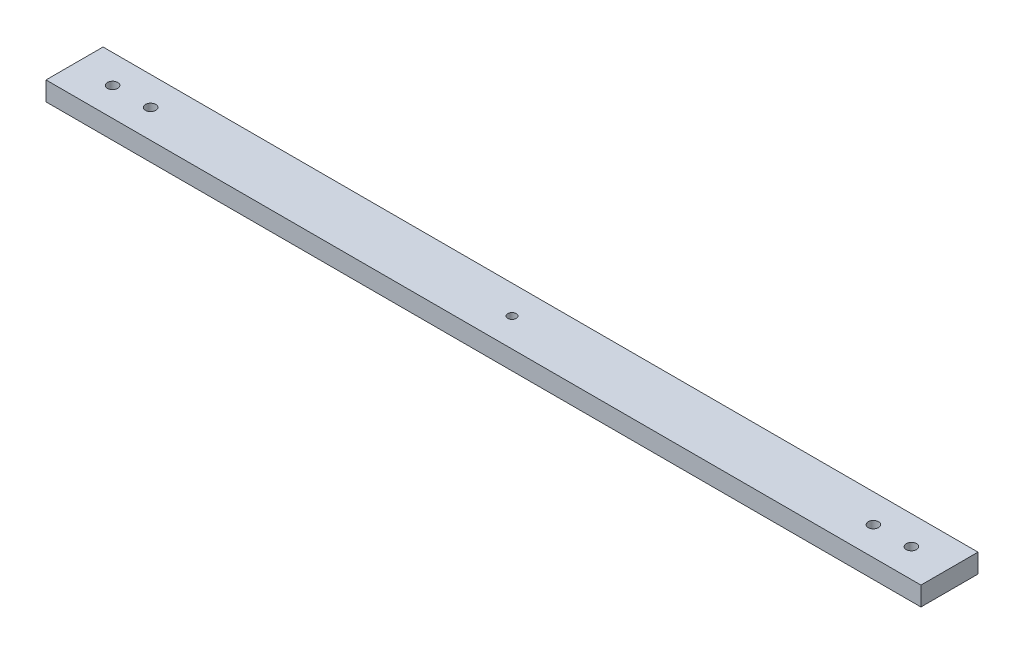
ISO-10303-21;
HEADER;
FILE_DESCRIPTION(('STEP AP214'),'2;1');
FILE_NAME('part.step','',(''),(''),'','','');
FILE_SCHEMA(('AUTOMOTIVE_DESIGN { 1 0 10303 214 1 1 1 1 }'));
ENDSEC;
DATA;
#1=APPLICATION_CONTEXT('core data for automotive mechanical design processes');
#2=APPLICATION_PROTOCOL_DEFINITION('international standard','automotive_design',2000,#1);
#3=PRODUCT_CONTEXT('',#1,'mechanical');
#4=PRODUCT('Part','Part','',(#3));
#5=PRODUCT_RELATED_PRODUCT_CATEGORY('part','',(#4));
#6=PRODUCT_DEFINITION_FORMATION('','',#4);
#7=PRODUCT_DEFINITION_CONTEXT('part definition',#1,'design');
#8=PRODUCT_DEFINITION('design','',#6,#7);
#9=PRODUCT_DEFINITION_SHAPE('','',#8);
#10=(LENGTH_UNIT() NAMED_UNIT(*) SI_UNIT(.MILLI.,.METRE.));
#11=(NAMED_UNIT(*) PLANE_ANGLE_UNIT() SI_UNIT($,.RADIAN.));
#12=(NAMED_UNIT(*) SI_UNIT($,.STERADIAN.) SOLID_ANGLE_UNIT());
#13=UNCERTAINTY_MEASURE_WITH_UNIT(LENGTH_MEASURE(1.E-05),#10,'distance_accuracy_value','');
#14=(GEOMETRIC_REPRESENTATION_CONTEXT(3) GLOBAL_UNCERTAINTY_ASSIGNED_CONTEXT((#13)) GLOBAL_UNIT_ASSIGNED_CONTEXT((#10,
#11,#12)) REPRESENTATION_CONTEXT('',''));
#15=CARTESIAN_POINT('',(0.,0.,0.));
#16=DIRECTION('',(0.,0.,1.));
#17=DIRECTION('',(1.,0.,0.));
#18=AXIS2_PLACEMENT_3D('',#15,#16,#17);
#19=CARTESIAN_POINT('',(0.,0.,0.));
#20=DIRECTION('',(0.,-1.,0.));
#21=DIRECTION('',(0.,0.,-1.));
#22=AXIS2_PLACEMENT_3D('',#19,#20,#21);
#23=PLANE('',#22);
#24=CARTESIAN_POINT('',(0.,0.,3.17499999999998));
#25=DIRECTION('',(0.,1.,0.));
#26=DIRECTION('',(0.,0.,1.));
#27=AXIS2_PLACEMENT_3D('',#24,#25,#26);
#28=CIRCLE('',#27,1.4224);
#29=CARTESIAN_POINT('',(0.,0.,4.59739999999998));
#30=VERTEX_POINT('',#29);
#31=EDGE_CURVE('E134',#30,#30,#28,.T.);
#32=ORIENTED_EDGE('',*,*,#31,.T.);
#33=EDGE_LOOP('',(#32));
#34=FACE_BOUND('',#33,.T.);
#35=CARTESIAN_POINT('',(133.35,0.,3.175));
#36=DIRECTION('',(0.,1.,0.));
#37=DIRECTION('',(0.,0.,1.));
#38=AXIS2_PLACEMENT_3D('',#35,#36,#37);
#39=CIRCLE('',#38,1.72719999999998);
#40=CARTESIAN_POINT('',(133.35,0.,4.90219999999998));
#41=VERTEX_POINT('',#40);
#42=EDGE_CURVE('E128',#41,#41,#39,.T.);
#43=ORIENTED_EDGE('',*,*,#42,.T.);
#44=EDGE_LOOP('',(#43));
#45=FACE_BOUND('',#44,.T.);
#46=DIRECTION('',(0.,0.,-1.));
#47=VECTOR('',#46,1.);
#48=CARTESIAN_POINT('',(146.05,0.,12.7));
#49=LINE('',#48,#47);
#50=CARTESIAN_POINT('',(146.05,0.,12.7));
#51=VERTEX_POINT('',#50);
#52=CARTESIAN_POINT('',(146.05,0.,-6.35));
#53=VERTEX_POINT('',#52);
#54=EDGE_CURVE('E97',#51,#53,#49,.T.);
#55=ORIENTED_EDGE('',*,*,#54,.F.);
#56=DIRECTION('',(1.,0.,0.));
#57=VECTOR('',#56,1.);
#58=CARTESIAN_POINT('',(-146.05,0.,12.7));
#59=LINE('',#58,#57);
#60=CARTESIAN_POINT('',(-146.05,0.,12.7));
#61=VERTEX_POINT('',#60);
#62=EDGE_CURVE('E73',#61,#51,#59,.T.);
#63=ORIENTED_EDGE('',*,*,#62,.F.);
#64=DIRECTION('',(0.,0.,1.));
#65=VECTOR('',#64,1.);
#66=CARTESIAN_POINT('',(-146.05,0.,12.7));
#67=LINE('',#66,#65);
#68=CARTESIAN_POINT('',(-146.05,0.,-6.35));
#69=VERTEX_POINT('',#68);
#70=EDGE_CURVE('E67',#69,#61,#67,.T.);
#71=ORIENTED_EDGE('',*,*,#70,.F.);
#72=DIRECTION('',(-1.,0.,0.));
#73=VECTOR('',#72,1.);
#74=CARTESIAN_POINT('',(-146.05,0.,-6.35));
#75=LINE('',#74,#73);
#76=EDGE_CURVE('E89',#53,#69,#75,.T.);
#77=ORIENTED_EDGE('',*,*,#76,.F.);
#78=EDGE_LOOP('',(#55,#63,#71,#77));
#79=FACE_BOUND('',#78,.T.);
#80=CARTESIAN_POINT('',(-120.65,0.,3.175));
#81=DIRECTION('',(0.,1.,0.));
#82=DIRECTION('',(0.,0.,1.));
#83=AXIS2_PLACEMENT_3D('',#80,#81,#82);
#84=CIRCLE('',#83,1.7272);
#85=CARTESIAN_POINT('',(-120.65,0.,4.9022));
#86=VERTEX_POINT('',#85);
#87=EDGE_CURVE('E100',#86,#86,#84,.T.);
#88=ORIENTED_EDGE('',*,*,#87,.T.);
#89=EDGE_LOOP('',(#88));
#90=FACE_BOUND('',#89,.T.);
#91=CARTESIAN_POINT('',(-133.35,0.,3.175));
#92=DIRECTION('',(0.,1.,0.));
#93=DIRECTION('',(0.,0.,1.));
#94=AXIS2_PLACEMENT_3D('',#91,#92,#93);
#95=CIRCLE('',#94,1.72719999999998);
#96=CARTESIAN_POINT('',(-133.35,0.,4.90219999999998));
#97=VERTEX_POINT('',#96);
#98=EDGE_CURVE('E116',#97,#97,#95,.T.);
#99=ORIENTED_EDGE('',*,*,#98,.T.);
#100=EDGE_LOOP('',(#99));
#101=FACE_BOUND('',#100,.T.);
#102=CARTESIAN_POINT('',(120.65,0.,3.175));
#103=DIRECTION('',(0.,1.,0.));
#104=DIRECTION('',(0.,0.,1.));
#105=AXIS2_PLACEMENT_3D('',#102,#103,#104);
#106=CIRCLE('',#105,1.7272);
#107=CARTESIAN_POINT('',(120.65,0.,4.9022));
#108=VERTEX_POINT('',#107);
#109=EDGE_CURVE('E122',#108,#108,#106,.T.);
#110=ORIENTED_EDGE('',*,*,#109,.T.);
#111=EDGE_LOOP('',(#110));
#112=FACE_BOUND('',#111,.T.);
#113=ADVANCED_FACE('F33',(#34,#45,#79,#90,#101,#112),#23,.T.);
#114=CARTESIAN_POINT('',(146.05,6.35,12.7));
#115=DIRECTION('',(-1.,0.,0.));
#116=DIRECTION('',(0.,0.,1.));
#117=AXIS2_PLACEMENT_3D('',#114,#115,#116);
#118=PLANE('',#117);
#119=ORIENTED_EDGE('',*,*,#54,.T.);
#120=DIRECTION('',(0.,-1.,0.));
#121=VECTOR('',#120,1.);
#122=CARTESIAN_POINT('',(146.05,6.35,-6.35));
#123=LINE('',#122,#121);
#124=CARTESIAN_POINT('',(146.05,6.35,-6.35));
#125=VERTEX_POINT('',#124);
#126=EDGE_CURVE('E11',#125,#53,#123,.T.);
#127=ORIENTED_EDGE('',*,*,#126,.F.);
#128=DIRECTION('',(0.,0.,-1.));
#129=VECTOR('',#128,1.);
#130=CARTESIAN_POINT('',(146.05,6.35,12.7));
#131=LINE('',#130,#129);
#132=CARTESIAN_POINT('',(146.05,6.35,12.7));
#133=VERTEX_POINT('',#132);
#134=EDGE_CURVE('E85',#133,#125,#131,.T.);
#135=ORIENTED_EDGE('',*,*,#134,.F.);
#136=DIRECTION('',(0.,-1.,0.));
#137=VECTOR('',#136,1.);
#138=CARTESIAN_POINT('',(146.05,6.35,12.7));
#139=LINE('',#138,#137);
#140=EDGE_CURVE('E93',#133,#51,#139,.T.);
#141=ORIENTED_EDGE('',*,*,#140,.T.);
#142=EDGE_LOOP('',(#119,#127,#135,#141));
#143=FACE_BOUND('',#142,.T.);
#144=ADVANCED_FACE('F35',(#143),#118,.F.);
#145=CARTESIAN_POINT('',(-146.05,6.35,-6.35));
#146=DIRECTION('',(0.,0.,1.));
#147=DIRECTION('',(1.,0.,0.));
#148=AXIS2_PLACEMENT_3D('',#145,#146,#147);
#149=PLANE('',#148);
#150=ORIENTED_EDGE('',*,*,#76,.T.);
#151=DIRECTION('',(0.,-1.,0.));
#152=VECTOR('',#151,1.);
#153=CARTESIAN_POINT('',(-146.05,6.35,-6.35));
#154=LINE('',#153,#152);
#155=CARTESIAN_POINT('',(-146.05,6.35,-6.35));
#156=VERTEX_POINT('',#155);
#157=EDGE_CURVE('E42',#156,#69,#154,.T.);
#158=ORIENTED_EDGE('',*,*,#157,.F.);
#159=DIRECTION('',(-1.,0.,0.));
#160=VECTOR('',#159,1.);
#161=CARTESIAN_POINT('',(-146.05,6.35,-6.35));
#162=LINE('',#161,#160);
#163=EDGE_CURVE('E80',#125,#156,#162,.T.);
#164=ORIENTED_EDGE('',*,*,#163,.F.);
#165=ORIENTED_EDGE('',*,*,#126,.T.);
#166=EDGE_LOOP('',(#150,#158,#164,#165));
#167=FACE_BOUND('',#166,.T.);
#168=ADVANCED_FACE('F88',(#167),#149,.F.);
#169=CARTESIAN_POINT('',(-146.05,6.35,12.7));
#170=DIRECTION('',(1.,0.,0.));
#171=DIRECTION('',(0.,0.,-1.));
#172=AXIS2_PLACEMENT_3D('',#169,#170,#171);
#173=PLANE('',#172);
#174=ORIENTED_EDGE('',*,*,#70,.T.);
#175=DIRECTION('',(0.,-1.,0.));
#176=VECTOR('',#175,1.);
#177=CARTESIAN_POINT('',(-146.05,6.35,12.7));
#178=LINE('',#177,#176);
#179=CARTESIAN_POINT('',(-146.05,6.35,12.7));
#180=VERTEX_POINT('',#179);
#181=EDGE_CURVE('E90',#180,#61,#178,.T.);
#182=ORIENTED_EDGE('',*,*,#181,.F.);
#183=DIRECTION('',(0.,0.,1.));
#184=VECTOR('',#183,1.);
#185=CARTESIAN_POINT('',(-146.05,6.35,12.7));
#186=LINE('',#185,#184);
#187=EDGE_CURVE('E83',#156,#180,#186,.T.);
#188=ORIENTED_EDGE('',*,*,#187,.F.);
#189=ORIENTED_EDGE('',*,*,#157,.T.);
#190=EDGE_LOOP('',(#174,#182,#188,#189));
#191=FACE_BOUND('',#190,.T.);
#192=ADVANCED_FACE('F91',(#191),#173,.F.);
#193=CARTESIAN_POINT('',(-146.05,6.35,12.7));
#194=DIRECTION('',(0.,0.,-1.));
#195=DIRECTION('',(-1.,0.,0.));
#196=AXIS2_PLACEMENT_3D('',#193,#194,#195);
#197=PLANE('',#196);
#198=ORIENTED_EDGE('',*,*,#62,.T.);
#199=ORIENTED_EDGE('',*,*,#140,.F.);
#200=DIRECTION('',(1.,0.,0.));
#201=VECTOR('',#200,1.);
#202=CARTESIAN_POINT('',(-146.05,6.35,12.7));
#203=LINE('',#202,#201);
#204=EDGE_CURVE('E50',#180,#133,#203,.T.);
#205=ORIENTED_EDGE('',*,*,#204,.F.);
#206=ORIENTED_EDGE('',*,*,#181,.T.);
#207=EDGE_LOOP('',(#198,#199,#205,#206));
#208=FACE_BOUND('',#207,.T.);
#209=ADVANCED_FACE('F105',(#208),#197,.F.);
#210=CARTESIAN_POINT('',(0.,6.35,0.));
#211=DIRECTION('',(0.,-1.,0.));
#212=DIRECTION('',(0.,0.,-1.));
#213=AXIS2_PLACEMENT_3D('',#210,#211,#212);
#214=PLANE('',#213);
#215=CARTESIAN_POINT('',(0.,6.35,3.17499999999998));
#216=DIRECTION('',(0.,1.,0.));
#217=DIRECTION('',(0.,0.,1.));
#218=AXIS2_PLACEMENT_3D('',#215,#216,#217);
#219=CIRCLE('',#218,1.42239999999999);
#220=CARTESIAN_POINT('',(0.,6.35,4.59739999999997));
#221=VERTEX_POINT('',#220);
#222=EDGE_CURVE('E137',#221,#221,#219,.T.);
#223=ORIENTED_EDGE('',*,*,#222,.F.);
#224=EDGE_LOOP('',(#223));
#225=FACE_BOUND('',#224,.T.);
#226=CARTESIAN_POINT('',(133.35,6.35,3.175));
#227=DIRECTION('',(0.,1.,0.));
#228=DIRECTION('',(0.,0.,1.));
#229=AXIS2_PLACEMENT_3D('',#226,#227,#228);
#230=CIRCLE('',#229,1.72719999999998);
#231=CARTESIAN_POINT('',(133.35,6.35,4.90219999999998));
#232=VERTEX_POINT('',#231);
#233=EDGE_CURVE('E131',#232,#232,#230,.T.);
#234=ORIENTED_EDGE('',*,*,#233,.F.);
#235=EDGE_LOOP('',(#234));
#236=FACE_BOUND('',#235,.T.);
#237=CARTESIAN_POINT('',(120.65,6.35,3.175));
#238=DIRECTION('',(0.,1.,0.));
#239=DIRECTION('',(0.,0.,1.));
#240=AXIS2_PLACEMENT_3D('',#237,#238,#239);
#241=CIRCLE('',#240,1.72719999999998);
#242=CARTESIAN_POINT('',(120.65,6.35,4.90219999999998));
#243=VERTEX_POINT('',#242);
#244=EDGE_CURVE('E125',#243,#243,#241,.T.);
#245=ORIENTED_EDGE('',*,*,#244,.F.);
#246=EDGE_LOOP('',(#245));
#247=FACE_BOUND('',#246,.T.);
#248=CARTESIAN_POINT('',(-133.35,6.35,3.175));
#249=DIRECTION('',(0.,1.,0.));
#250=DIRECTION('',(0.,0.,1.));
#251=AXIS2_PLACEMENT_3D('',#248,#249,#250);
#252=CIRCLE('',#251,1.72719999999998);
#253=CARTESIAN_POINT('',(-133.35,6.35,4.90219999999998));
#254=VERTEX_POINT('',#253);
#255=EDGE_CURVE('E119',#254,#254,#252,.T.);
#256=ORIENTED_EDGE('',*,*,#255,.F.);
#257=EDGE_LOOP('',(#256));
#258=FACE_BOUND('',#257,.T.);
#259=CARTESIAN_POINT('',(-120.65,6.35,3.175));
#260=DIRECTION('',(0.,1.,0.));
#261=DIRECTION('',(0.,0.,1.));
#262=AXIS2_PLACEMENT_3D('',#259,#260,#261);
#263=CIRCLE('',#262,1.72719999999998);
#264=CARTESIAN_POINT('',(-120.65,6.35,4.90219999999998));
#265=VERTEX_POINT('',#264);
#266=EDGE_CURVE('E113',#265,#265,#263,.T.);
#267=ORIENTED_EDGE('',*,*,#266,.F.);
#268=EDGE_LOOP('',(#267));
#269=FACE_BOUND('',#268,.T.);
#270=ORIENTED_EDGE('',*,*,#134,.T.);
#271=ORIENTED_EDGE('',*,*,#163,.T.);
#272=ORIENTED_EDGE('',*,*,#187,.T.);
#273=ORIENTED_EDGE('',*,*,#204,.T.);
#274=EDGE_LOOP('',(#270,#271,#272,#273));
#275=FACE_BOUND('',#274,.T.);
#276=ADVANCED_FACE('F81',(#225,#236,#247,#258,#269,#275),#214,.F.);
#277=CARTESIAN_POINT('',(-120.65,6.35,3.175));
#278=DIRECTION('',(0.,1.,0.));
#279=DIRECTION('',(0.,0.,1.));
#280=AXIS2_PLACEMENT_3D('',#277,#278,#279);
#281=CYLINDRICAL_SURFACE('',#280,1.72719999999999);
#282=ORIENTED_EDGE('',*,*,#87,.F.);
#283=EDGE_LOOP('',(#282));
#284=FACE_BOUND('',#283,.T.);
#285=ORIENTED_EDGE('',*,*,#266,.T.);
#286=EDGE_LOOP('',(#285));
#287=FACE_BOUND('',#286,.T.);
#288=ADVANCED_FACE('F145',(#284,#287),#281,.F.);
#289=CARTESIAN_POINT('',(-133.35,6.35,3.175));
#290=DIRECTION('',(0.,1.,0.));
#291=DIRECTION('',(0.,0.,1.));
#292=AXIS2_PLACEMENT_3D('',#289,#290,#291);
#293=CYLINDRICAL_SURFACE('',#292,1.72719999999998);
#294=ORIENTED_EDGE('',*,*,#98,.F.);
#295=EDGE_LOOP('',(#294));
#296=FACE_BOUND('',#295,.T.);
#297=ORIENTED_EDGE('',*,*,#255,.T.);
#298=EDGE_LOOP('',(#297));
#299=FACE_BOUND('',#298,.T.);
#300=ADVANCED_FACE('F156',(#296,#299),#293,.F.);
#301=CARTESIAN_POINT('',(120.65,6.35,3.175));
#302=DIRECTION('',(0.,1.,0.));
#303=DIRECTION('',(0.,0.,1.));
#304=AXIS2_PLACEMENT_3D('',#301,#302,#303);
#305=CYLINDRICAL_SURFACE('',#304,1.72719999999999);
#306=ORIENTED_EDGE('',*,*,#109,.F.);
#307=EDGE_LOOP('',(#306));
#308=FACE_BOUND('',#307,.T.);
#309=ORIENTED_EDGE('',*,*,#244,.T.);
#310=EDGE_LOOP('',(#309));
#311=FACE_BOUND('',#310,.T.);
#312=ADVANCED_FACE('F162',(#308,#311),#305,.F.);
#313=CARTESIAN_POINT('',(133.35,6.35,3.175));
#314=DIRECTION('',(0.,1.,0.));
#315=DIRECTION('',(0.,0.,1.));
#316=AXIS2_PLACEMENT_3D('',#313,#314,#315);
#317=CYLINDRICAL_SURFACE('',#316,1.72719999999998);
#318=ORIENTED_EDGE('',*,*,#42,.F.);
#319=EDGE_LOOP('',(#318));
#320=FACE_BOUND('',#319,.T.);
#321=ORIENTED_EDGE('',*,*,#233,.T.);
#322=EDGE_LOOP('',(#321));
#323=FACE_BOUND('',#322,.T.);
#324=ADVANCED_FACE('F206',(#320,#323),#317,.F.);
#325=CARTESIAN_POINT('',(0.,6.35,3.17499999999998));
#326=DIRECTION('',(0.,1.,0.));
#327=DIRECTION('',(0.,0.,1.));
#328=AXIS2_PLACEMENT_3D('',#325,#326,#327);
#329=CYLINDRICAL_SURFACE('',#328,1.42239999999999);
#330=ORIENTED_EDGE('',*,*,#31,.F.);
#331=EDGE_LOOP('',(#330));
#332=FACE_BOUND('',#331,.T.);
#333=ORIENTED_EDGE('',*,*,#222,.T.);
#334=EDGE_LOOP('',(#333));
#335=FACE_BOUND('',#334,.T.);
#336=ADVANCED_FACE('F141',(#332,#335),#329,.F.);
#337=CLOSED_SHELL('',(#113,#144,#168,#192,#209,#276,#288,#300,#312,#324,#336));
#338=MANIFOLD_SOLID_BREP('B2',#337);
#339=ADVANCED_BREP_SHAPE_REPRESENTATION('',(#18,#338),#14);
#340=SHAPE_DEFINITION_REPRESENTATION(#9,#339);
ENDSEC;
END-ISO-10303-21;
